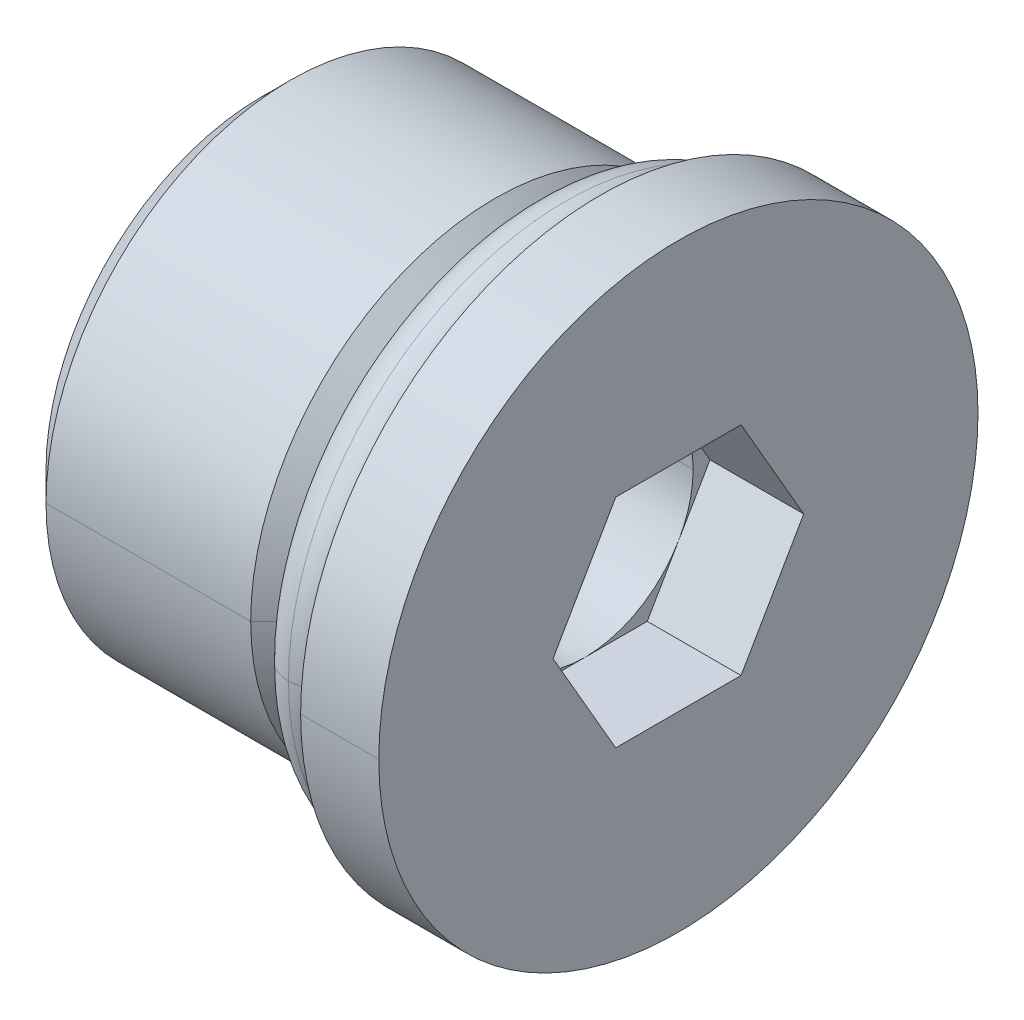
ISO-10303-21;
HEADER;
FILE_DESCRIPTION(('STEP AP214'),'2;1');
FILE_NAME('part.step','',(''),(''),'','','');
FILE_SCHEMA(('AUTOMOTIVE_DESIGN { 1 0 10303 214 1 1 1 1 }'));
ENDSEC;
DATA;
#1=APPLICATION_CONTEXT('core data for automotive mechanical design processes');
#2=APPLICATION_PROTOCOL_DEFINITION('international standard','automotive_design',2000,#1);
#3=PRODUCT_CONTEXT('',#1,'mechanical');
#4=PRODUCT('Part','Part','',(#3));
#5=PRODUCT_RELATED_PRODUCT_CATEGORY('part','',(#4));
#6=PRODUCT_DEFINITION_FORMATION('','',#4);
#7=PRODUCT_DEFINITION_CONTEXT('part definition',#1,'design');
#8=PRODUCT_DEFINITION('design','',#6,#7);
#9=PRODUCT_DEFINITION_SHAPE('','',#8);
#10=(LENGTH_UNIT() NAMED_UNIT(*) SI_UNIT(.MILLI.,.METRE.));
#11=(NAMED_UNIT(*) PLANE_ANGLE_UNIT() SI_UNIT($,.RADIAN.));
#12=(NAMED_UNIT(*) SI_UNIT($,.STERADIAN.) SOLID_ANGLE_UNIT());
#13=UNCERTAINTY_MEASURE_WITH_UNIT(LENGTH_MEASURE(1.E-05),#10,'distance_accuracy_value','');
#14=(GEOMETRIC_REPRESENTATION_CONTEXT(3) GLOBAL_UNCERTAINTY_ASSIGNED_CONTEXT((#13)) GLOBAL_UNIT_ASSIGNED_CONTEXT((#10,
#11,#12)) REPRESENTATION_CONTEXT('',''));
#15=CARTESIAN_POINT('',(0.,0.,0.));
#16=DIRECTION('',(0.,0.,1.));
#17=DIRECTION('',(1.,0.,0.));
#18=AXIS2_PLACEMENT_3D('',#15,#16,#17);
#19=CARTESIAN_POINT('',(8.89,0.,0.));
#20=DIRECTION('',(-1.,0.,0.));
#21=DIRECTION('',(0.,0.,1.));
#22=AXIS2_PLACEMENT_3D('',#19,#20,#21);
#23=TOROIDAL_SURFACE('',#22,7.112,0.9906);
#24=CARTESIAN_POINT('',(8.89,0.,0.));
#25=DIRECTION('',(-1.,0.,0.));
#26=DIRECTION('',(0.,0.,1.));
#27=AXIS2_PLACEMENT_3D('',#24,#25,#26);
#28=CIRCLE('',#27,8.1026);
#29=CARTESIAN_POINT('',(8.89,0.,-8.1026));
#30=VERTEX_POINT('',#29);
#31=CARTESIAN_POINT('',(8.89,0.,8.1026));
#32=VERTEX_POINT('',#31);
#33=EDGE_CURVE('P0_E19',#30,#32,#28,.T.);
#34=ORIENTED_EDGE('',*,*,#33,.F.);
#35=CARTESIAN_POINT('',(8.89,0.,-7.112));
#36=DIRECTION('',(0.,-1.,0.));
#37=DIRECTION('',(0.,0.,-1.));
#38=AXIS2_PLACEMENT_3D('',#35,#36,#37);
#39=CIRCLE('',#38,0.9906);
#40=CARTESIAN_POINT('',(8.89,0.,-6.1214));
#41=VERTEX_POINT('',#40);
#42=EDGE_CURVE('P0_E61',#30,#41,#39,.T.);
#43=ORIENTED_EDGE('',*,*,#42,.T.);
#44=CARTESIAN_POINT('',(8.89,0.,0.));
#45=DIRECTION('',(1.,0.,0.));
#46=DIRECTION('',(0.,0.,1.));
#47=AXIS2_PLACEMENT_3D('',#44,#45,#46);
#48=CIRCLE('',#47,6.1214);
#49=CARTESIAN_POINT('',(8.89,0.,6.1214));
#50=VERTEX_POINT('',#49);
#51=EDGE_CURVE('P0_E11',#50,#41,#48,.T.);
#52=ORIENTED_EDGE('',*,*,#51,.F.);
#53=CARTESIAN_POINT('',(8.89,0.,7.112));
#54=DIRECTION('',(0.,-1.,0.));
#55=DIRECTION('',(0.,0.,1.));
#56=AXIS2_PLACEMENT_3D('',#53,#54,#55);
#57=CIRCLE('',#56,0.9906);
#58=EDGE_CURVE('P0_E62',#50,#32,#57,.T.);
#59=ORIENTED_EDGE('',*,*,#58,.T.);
#60=EDGE_LOOP('',(#34,#43,#52,#59));
#61=FACE_BOUND('',#60,.T.);
#62=ADVANCED_FACE('P0_F16',(#61),#23,.T.);
#63=CARTESIAN_POINT('',(8.89,0.,0.));
#64=DIRECTION('',(-1.,0.,0.));
#65=DIRECTION('',(0.,0.,1.));
#66=AXIS2_PLACEMENT_3D('',#63,#64,#65);
#67=TOROIDAL_SURFACE('',#66,7.112,0.9906);
#68=ORIENTED_EDGE('',*,*,#33,.T.);
#69=CARTESIAN_POINT('',(8.89,0.,7.112));
#70=DIRECTION('',(0.,-1.,0.));
#71=DIRECTION('',(0.,0.,1.));
#72=AXIS2_PLACEMENT_3D('',#69,#70,#71);
#73=CIRCLE('',#72,0.9906);
#74=EDGE_CURVE('P0_E54',#32,#50,#73,.T.);
#75=ORIENTED_EDGE('',*,*,#74,.T.);
#76=ORIENTED_EDGE('',*,*,#51,.T.);
#77=CARTESIAN_POINT('',(8.89,0.,-7.112));
#78=DIRECTION('',(0.,-1.,0.));
#79=DIRECTION('',(0.,0.,-1.));
#80=AXIS2_PLACEMENT_3D('',#77,#78,#79);
#81=CIRCLE('',#80,0.9906);
#82=EDGE_CURVE('P0_E57',#41,#30,#81,.T.);
#83=ORIENTED_EDGE('',*,*,#82,.T.);
#84=EDGE_LOOP('',(#68,#75,#76,#83));
#85=FACE_BOUND('',#84,.T.);
#86=ADVANCED_FACE('P0_F52',(#85),#67,.T.);
#87=CARTESIAN_POINT('',(8.89,0.,0.));
#88=DIRECTION('',(-1.,0.,0.));
#89=DIRECTION('',(0.,0.,1.));
#90=AXIS2_PLACEMENT_3D('',#87,#88,#89);
#91=TOROIDAL_SURFACE('',#90,7.112,0.9906);
#92=CARTESIAN_POINT('',(8.89,0.,0.));
#93=DIRECTION('',(-1.,0.,0.));
#94=DIRECTION('',(0.,0.,1.));
#95=AXIS2_PLACEMENT_3D('',#92,#93,#94);
#96=CIRCLE('',#95,8.1026);
#97=EDGE_CURVE('P0_E70',#32,#30,#96,.T.);
#98=ORIENTED_EDGE('',*,*,#97,.F.);
#99=ORIENTED_EDGE('',*,*,#58,.F.);
#100=CARTESIAN_POINT('',(8.89,0.,0.));
#101=DIRECTION('',(1.,0.,0.));
#102=DIRECTION('',(0.,0.,1.));
#103=AXIS2_PLACEMENT_3D('',#100,#101,#102);
#104=CIRCLE('',#103,6.1214);
#105=EDGE_CURVE('P0_E71',#41,#50,#104,.T.);
#106=ORIENTED_EDGE('',*,*,#105,.F.);
#107=ORIENTED_EDGE('',*,*,#42,.F.);
#108=EDGE_LOOP('',(#98,#99,#106,#107));
#109=FACE_BOUND('',#108,.T.);
#110=ADVANCED_FACE('P0_F74',(#109),#91,.T.);
#111=CARTESIAN_POINT('',(8.89,0.,0.));
#112=DIRECTION('',(-1.,0.,0.));
#113=DIRECTION('',(0.,0.,1.));
#114=AXIS2_PLACEMENT_3D('',#111,#112,#113);
#115=TOROIDAL_SURFACE('',#114,7.112,0.9906);
#116=ORIENTED_EDGE('',*,*,#97,.T.);
#117=ORIENTED_EDGE('',*,*,#82,.F.);
#118=ORIENTED_EDGE('',*,*,#105,.T.);
#119=ORIENTED_EDGE('',*,*,#74,.F.);
#120=EDGE_LOOP('',(#116,#117,#118,#119));
#121=FACE_BOUND('',#120,.T.);
#122=ADVANCED_FACE('P0_F69',(#121),#115,.T.);
#123=CLOSED_SHELL('',(#62,#86,#110,#122));
#124=MANIFOLD_SOLID_BREP('P0_B1',#123);
#125=CARTESIAN_POINT('',(11.049,0.,0.));
#126=DIRECTION('',(1.,0.,0.));
#127=DIRECTION('',(0.,0.,1.));
#128=AXIS2_PLACEMENT_3D('',#125,#126,#127);
#129=CYLINDRICAL_SURFACE('',#128,8.763);
#130=DIRECTION('',(1.,0.,0.));
#131=VECTOR('',#130,1.);
#132=CARTESIAN_POINT('',(11.049,0.,8.763));
#133=LINE('',#132,#131);
#134=CARTESIAN_POINT('',(9.906,0.,8.763));
#135=VERTEX_POINT('',#134);
#136=CARTESIAN_POINT('',(12.192,0.,8.763));
#137=VERTEX_POINT('',#136);
#138=EDGE_CURVE('P1_E24',#135,#137,#133,.T.);
#139=ORIENTED_EDGE('',*,*,#138,.F.);
#140=CARTESIAN_POINT('',(9.906,0.,0.));
#141=DIRECTION('',(1.,0.,0.));
#142=DIRECTION('',(0.,0.,1.));
#143=AXIS2_PLACEMENT_3D('',#140,#141,#142);
#144=CIRCLE('',#143,8.763);
#145=CARTESIAN_POINT('',(9.906,0.,-8.763));
#146=VERTEX_POINT('',#145);
#147=EDGE_CURVE('P1_E405',#135,#146,#144,.T.);
#148=ORIENTED_EDGE('',*,*,#147,.T.);
#149=DIRECTION('',(-1.,0.,0.));
#150=VECTOR('',#149,1.);
#151=CARTESIAN_POINT('',(11.049,0.,-8.763));
#152=LINE('',#151,#150);
#153=CARTESIAN_POINT('',(12.192,0.,-8.763));
#154=VERTEX_POINT('',#153);
#155=EDGE_CURVE('P1_E11',#154,#146,#152,.T.);
#156=ORIENTED_EDGE('',*,*,#155,.F.);
#157=CARTESIAN_POINT('',(12.192,0.,0.));
#158=DIRECTION('',(1.,0.,0.));
#159=DIRECTION('',(0.,0.,1.));
#160=AXIS2_PLACEMENT_3D('',#157,#158,#159);
#161=CIRCLE('',#160,8.763);
#162=EDGE_CURVE('P1_E336',#137,#154,#161,.T.);
#163=ORIENTED_EDGE('',*,*,#162,.F.);
#164=EDGE_LOOP('',(#139,#148,#156,#163));
#165=FACE_BOUND('',#164,.T.);
#166=ADVANCED_FACE('P1_F16',(#165),#129,.T.);
#167=CARTESIAN_POINT('',(11.049,0.,0.));
#168=DIRECTION('',(1.,0.,0.));
#169=DIRECTION('',(0.,0.,1.));
#170=AXIS2_PLACEMENT_3D('',#167,#168,#169);
#171=CYLINDRICAL_SURFACE('',#170,8.763);
#172=ORIENTED_EDGE('',*,*,#138,.T.);
#173=CARTESIAN_POINT('',(12.192,0.,0.));
#174=DIRECTION('',(1.,0.,0.));
#175=DIRECTION('',(0.,0.,1.));
#176=AXIS2_PLACEMENT_3D('',#173,#174,#175);
#177=CIRCLE('',#176,8.763);
#178=EDGE_CURVE('P1_E340',#154,#137,#177,.T.);
#179=ORIENTED_EDGE('',*,*,#178,.F.);
#180=ORIENTED_EDGE('',*,*,#155,.T.);
#181=CARTESIAN_POINT('',(9.906,0.,0.));
#182=DIRECTION('',(1.,0.,0.));
#183=DIRECTION('',(0.,0.,1.));
#184=AXIS2_PLACEMENT_3D('',#181,#182,#183);
#185=CIRCLE('',#184,8.763);
#186=EDGE_CURVE('P1_E408',#146,#135,#185,.T.);
#187=ORIENTED_EDGE('',*,*,#186,.T.);
#188=EDGE_LOOP('',(#172,#179,#180,#187));
#189=FACE_BOUND('',#188,.T.);
#190=ADVANCED_FACE('P1_F413',(#189),#171,.T.);
#191=CARTESIAN_POINT('',(9.906,0.,4.3815));
#192=DIRECTION('',(-1.,0.,0.));
#193=DIRECTION('',(0.,0.,1.));
#194=AXIS2_PLACEMENT_3D('',#191,#192,#193);
#195=PLANE('',#194);
#196=ORIENTED_EDGE('',*,*,#147,.F.);
#197=ORIENTED_EDGE('',*,*,#186,.F.);
#198=EDGE_LOOP('',(#196,#197));
#199=FACE_BOUND('',#198,.T.);
#200=CARTESIAN_POINT('',(9.906,0.,0.));
#201=DIRECTION('',(1.,0.,0.));
#202=DIRECTION('',(0.,0.,1.));
#203=AXIS2_PLACEMENT_3D('',#200,#201,#202);
#204=CIRCLE('',#203,6.096);
#205=CARTESIAN_POINT('',(9.906,0.,6.096));
#206=VERTEX_POINT('',#205);
#207=CARTESIAN_POINT('',(9.906,0.,-6.096));
#208=VERTEX_POINT('',#207);
#209=EDGE_CURVE('P1_E341',#206,#208,#204,.T.);
#210=ORIENTED_EDGE('',*,*,#209,.T.);
#211=CARTESIAN_POINT('',(9.906,0.,0.));
#212=DIRECTION('',(1.,0.,0.));
#213=DIRECTION('',(0.,0.,1.));
#214=AXIS2_PLACEMENT_3D('',#211,#212,#213);
#215=CIRCLE('',#214,6.096);
#216=EDGE_CURVE('P1_E268',#208,#206,#215,.T.);
#217=ORIENTED_EDGE('',*,*,#216,.T.);
#218=EDGE_LOOP('',(#210,#217));
#219=FACE_BOUND('',#218,.T.);
#220=ADVANCED_FACE('P1_F419',(#199,#219),#195,.T.);
#221=CARTESIAN_POINT('',(12.192,0.,4.3815));
#222=DIRECTION('',(1.,0.,0.));
#223=DIRECTION('',(0.,0.,1.));
#224=AXIS2_PLACEMENT_3D('',#221,#222,#223);
#225=PLANE('',#224);
#226=ORIENTED_EDGE('',*,*,#162,.T.);
#227=ORIENTED_EDGE('',*,*,#178,.T.);
#228=EDGE_LOOP('',(#226,#227));
#229=FACE_BOUND('',#228,.T.);
#230=DIRECTION('',(0.,0.,-1.));
#231=VECTOR('',#230,1.);
#232=CARTESIAN_POINT('',(12.192,3.175,2.19075));
#233=LINE('',#232,#231);
#234=CARTESIAN_POINT('',(12.192,3.175,1.83308710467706));
#235=VERTEX_POINT('',#234);
#236=CARTESIAN_POINT('',(12.192,3.175,-1.83308710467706));
#237=VERTEX_POINT('',#236);
#238=EDGE_CURVE('P1_E392',#235,#237,#233,.T.);
#239=ORIENTED_EDGE('',*,*,#238,.T.);
#240=DIRECTION('',(0.,-0.866025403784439,-0.5));
#241=VECTOR('',#240,1.);
#242=CARTESIAN_POINT('',(12.192,1.74237257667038,-2.66021493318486));
#243=LINE('',#242,#241);
#244=CARTESIAN_POINT('',(12.192,0.,-3.66617420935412));
#245=VERTEX_POINT('',#244);
#246=EDGE_CURVE('P1_E386',#237,#245,#243,.T.);
#247=ORIENTED_EDGE('',*,*,#246,.T.);
#248=DIRECTION('',(0.,-0.866025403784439,0.5));
#249=VECTOR('',#248,1.);
#250=CARTESIAN_POINT('',(12.192,-3.32987257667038,-1.74367138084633));
#251=LINE('',#250,#249);
#252=CARTESIAN_POINT('',(12.192,-3.175,-1.83308710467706));
#253=VERTEX_POINT('',#252);
#254=EDGE_CURVE('P1_E319',#245,#253,#251,.T.);
#255=ORIENTED_EDGE('',*,*,#254,.T.);
#256=DIRECTION('',(0.,0.,1.));
#257=VECTOR('',#256,1.);
#258=CARTESIAN_POINT('',(12.192,-3.175,3.10729355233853));
#259=LINE('',#258,#257);
#260=CARTESIAN_POINT('',(12.192,-3.175,1.83308710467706));
#261=VERTEX_POINT('',#260);
#262=EDGE_CURVE('P1_E346',#253,#261,#259,.T.);
#263=ORIENTED_EDGE('',*,*,#262,.T.);
#264=DIRECTION('',(0.,0.866025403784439,0.5));
#265=VECTOR('',#264,1.);
#266=CARTESIAN_POINT('',(12.192,0.154872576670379,3.75558993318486));
#267=LINE('',#266,#265);
#268=CARTESIAN_POINT('',(12.192,0.,3.66617420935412));
#269=VERTEX_POINT('',#268);
#270=EDGE_CURVE('P1_E377',#261,#269,#267,.T.);
#271=ORIENTED_EDGE('',*,*,#270,.T.);
#272=DIRECTION('',(0.,0.866025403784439,-0.5));
#273=VECTOR('',#272,1.);
#274=CARTESIAN_POINT('',(12.192,1.43262742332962,2.83904638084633));
#275=LINE('',#274,#273);
#276=EDGE_CURVE('P1_E370',#269,#235,#275,.T.);
#277=ORIENTED_EDGE('',*,*,#276,.T.);
#278=EDGE_LOOP('',(#239,#247,#255,#263,#271,#277));
#279=FACE_BOUND('',#278,.T.);
#280=ADVANCED_FACE('P1_F416',(#229,#279),#225,.T.);
#281=CARTESIAN_POINT('',(8.89,0.,0.));
#282=DIRECTION('',(1.,0.,0.));
#283=DIRECTION('',(0.,0.,1.));
#284=AXIS2_PLACEMENT_3D('',#281,#282,#283);
#285=CYLINDRICAL_SURFACE('',#284,6.096);
#286=DIRECTION('',(1.,0.,0.));
#287=VECTOR('',#286,1.);
#288=CARTESIAN_POINT('',(8.89,0.,6.096));
#289=LINE('',#288,#287);
#290=CARTESIAN_POINT('',(7.874,0.,6.096));
#291=VERTEX_POINT('',#290);
#292=EDGE_CURVE('P1_E273',#291,#206,#289,.T.);
#293=ORIENTED_EDGE('',*,*,#292,.F.);
#294=CARTESIAN_POINT('',(7.874,0.,0.));
#295=DIRECTION('',(1.,0.,0.));
#296=DIRECTION('',(0.,0.,1.));
#297=AXIS2_PLACEMENT_3D('',#294,#295,#296);
#298=CIRCLE('',#297,6.096);
#299=CARTESIAN_POINT('',(7.874,0.,-6.096));
#300=VERTEX_POINT('',#299);
#301=EDGE_CURVE('P1_E230',#291,#300,#298,.T.);
#302=ORIENTED_EDGE('',*,*,#301,.T.);
#303=DIRECTION('',(-1.,0.,0.));
#304=VECTOR('',#303,1.);
#305=CARTESIAN_POINT('',(8.89,0.,-6.096));
#306=LINE('',#305,#304);
#307=EDGE_CURVE('P1_E272',#208,#300,#306,.T.);
#308=ORIENTED_EDGE('',*,*,#307,.F.);
#309=ORIENTED_EDGE('',*,*,#209,.F.);
#310=EDGE_LOOP('',(#293,#302,#308,#309));
#311=FACE_BOUND('',#310,.T.);
#312=ADVANCED_FACE('P1_F426',(#311),#285,.T.);
#313=CARTESIAN_POINT('',(8.89,0.,0.));
#314=DIRECTION('',(1.,0.,0.));
#315=DIRECTION('',(0.,0.,1.));
#316=AXIS2_PLACEMENT_3D('',#313,#314,#315);
#317=CYLINDRICAL_SURFACE('',#316,6.096);
#318=ORIENTED_EDGE('',*,*,#292,.T.);
#319=ORIENTED_EDGE('',*,*,#216,.F.);
#320=ORIENTED_EDGE('',*,*,#307,.T.);
#321=CARTESIAN_POINT('',(7.874,0.,0.));
#322=DIRECTION('',(1.,0.,0.));
#323=DIRECTION('',(0.,0.,1.));
#324=AXIS2_PLACEMENT_3D('',#321,#322,#323);
#325=CIRCLE('',#324,6.096);
#326=EDGE_CURVE('P1_E231',#300,#291,#325,.T.);
#327=ORIENTED_EDGE('',*,*,#326,.T.);
#328=EDGE_LOOP('',(#318,#319,#320,#327));
#329=FACE_BOUND('',#328,.T.);
#330=ADVANCED_FACE('P1_F430',(#329),#317,.T.);
#331=CARTESIAN_POINT('',(12.192,3.175,0.));
#332=DIRECTION('',(0.,1.,0.));
#333=DIRECTION('',(0.,0.,-1.));
#334=AXIS2_PLACEMENT_3D('',#331,#332,#333);
#335=PLANE('',#334);
#336=DIRECTION('',(-1.,0.,0.));
#337=VECTOR('',#336,1.);
#338=CARTESIAN_POINT('',(12.192,3.175,-1.83308710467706));
#339=LINE('',#338,#337);
#340=CARTESIAN_POINT('',(9.4488,3.175,-1.83308710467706));
#341=VERTEX_POINT('',#340);
#342=EDGE_CURVE('P1_E389',#237,#341,#339,.T.);
#343=ORIENTED_EDGE('',*,*,#342,.F.);
#344=ORIENTED_EDGE('',*,*,#238,.F.);
#345=DIRECTION('',(-1.,0.,0.));
#346=VECTOR('',#345,1.);
#347=CARTESIAN_POINT('',(12.192,3.175,1.83308710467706));
#348=LINE('',#347,#346);
#349=CARTESIAN_POINT('',(9.4488,3.175,1.83308710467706));
#350=VERTEX_POINT('',#349);
#351=EDGE_CURVE('P1_E367',#235,#350,#348,.T.);
#352=ORIENTED_EDGE('',*,*,#351,.T.);
#353=DIRECTION('',(0.,0.,1.));
#354=VECTOR('',#353,1.);
#355=CARTESIAN_POINT('',(9.4488,3.175,1.83308710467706));
#356=LINE('',#355,#354);
#357=CARTESIAN_POINT('',(9.4488,3.175,0.));
#358=VERTEX_POINT('',#357);
#359=EDGE_CURVE('P1_E353',#358,#350,#356,.T.);
#360=ORIENTED_EDGE('',*,*,#359,.F.);
#361=DIRECTION('',(0.,0.,1.));
#362=VECTOR('',#361,1.);
#363=CARTESIAN_POINT('',(9.4488,3.175,1.83308710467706));
#364=LINE('',#363,#362);
#365=EDGE_CURVE('P1_E345',#341,#358,#364,.T.);
#366=ORIENTED_EDGE('',*,*,#365,.F.);
#367=EDGE_LOOP('',(#343,#344,#352,#360,#366));
#368=FACE_BOUND('',#367,.T.);
#369=ADVANCED_FACE('P1_F469',(#368),#335,.F.);
#370=CARTESIAN_POINT('',(12.192,0.,-3.66617420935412));
#371=DIRECTION('',(0.,0.5,-0.866025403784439));
#372=DIRECTION('',(-1.,0.,0.));
#373=AXIS2_PLACEMENT_3D('',#370,#371,#372);
#374=PLANE('',#373);
#375=DIRECTION('',(-1.,0.,0.));
#376=VECTOR('',#375,1.);
#377=CARTESIAN_POINT('',(12.192,0.,-3.66617420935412));
#378=LINE('',#377,#376);
#379=CARTESIAN_POINT('',(9.4488,0.,-3.66617420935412));
#380=VERTEX_POINT('',#379);
#381=EDGE_CURVE('P1_E322',#245,#380,#378,.T.);
#382=ORIENTED_EDGE('',*,*,#381,.F.);
#383=ORIENTED_EDGE('',*,*,#246,.F.);
#384=ORIENTED_EDGE('',*,*,#342,.T.);
#385=DIRECTION('',(0.,0.866025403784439,0.5));
#386=VECTOR('',#385,1.);
#387=CARTESIAN_POINT('',(9.4488,3.175,-1.83308710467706));
#388=LINE('',#387,#386);
#389=CARTESIAN_POINT('',(9.4488,1.5875,-2.74963065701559));
#390=VERTEX_POINT('',#389);
#391=EDGE_CURVE('P1_E335',#390,#341,#388,.T.);
#392=ORIENTED_EDGE('',*,*,#391,.F.);
#393=DIRECTION('',(0.,0.866025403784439,0.5));
#394=VECTOR('',#393,1.);
#395=CARTESIAN_POINT('',(9.4488,3.175,-1.83308710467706));
#396=LINE('',#395,#394);
#397=EDGE_CURVE('P1_E331',#380,#390,#396,.T.);
#398=ORIENTED_EDGE('',*,*,#397,.F.);
#399=EDGE_LOOP('',(#382,#383,#384,#392,#398));
#400=FACE_BOUND('',#399,.T.);
#401=ADVANCED_FACE('P1_F472',(#400),#374,.F.);
#402=CARTESIAN_POINT('',(12.192,-3.175,-1.83308710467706));
#403=DIRECTION('',(0.,-0.5,-0.866025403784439));
#404=DIRECTION('',(0.,-0.866025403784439,0.5));
#405=AXIS2_PLACEMENT_3D('',#402,#403,#404);
#406=PLANE('',#405);
#407=DIRECTION('',(-1.,0.,0.));
#408=VECTOR('',#407,1.);
#409=CARTESIAN_POINT('',(12.192,-3.175,-1.83308710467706));
#410=LINE('',#409,#408);
#411=CARTESIAN_POINT('',(9.4488,-3.175,-1.83308710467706));
#412=VERTEX_POINT('',#411);
#413=EDGE_CURVE('P1_E323',#253,#412,#410,.T.);
#414=ORIENTED_EDGE('',*,*,#413,.F.);
#415=ORIENTED_EDGE('',*,*,#254,.F.);
#416=ORIENTED_EDGE('',*,*,#381,.T.);
#417=DIRECTION('',(0.,0.866025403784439,-0.5));
#418=VECTOR('',#417,1.);
#419=CARTESIAN_POINT('',(9.4488,0.,-3.66617420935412));
#420=LINE('',#419,#418);
#421=CARTESIAN_POINT('',(9.4488,-1.5875,-2.74963065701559));
#422=VERTEX_POINT('',#421);
#423=EDGE_CURVE('P1_E327',#422,#380,#420,.T.);
#424=ORIENTED_EDGE('',*,*,#423,.F.);
#425=DIRECTION('',(0.,0.866025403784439,-0.5));
#426=VECTOR('',#425,1.);
#427=CARTESIAN_POINT('',(9.4488,0.,-3.66617420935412));
#428=LINE('',#427,#426);
#429=EDGE_CURVE('P1_E318',#412,#422,#428,.T.);
#430=ORIENTED_EDGE('',*,*,#429,.F.);
#431=EDGE_LOOP('',(#414,#415,#416,#424,#430));
#432=FACE_BOUND('',#431,.T.);
#433=ADVANCED_FACE('P1_F476',(#432),#406,.F.);
#434=CARTESIAN_POINT('',(12.192,-3.175,1.83308710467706));
#435=DIRECTION('',(0.,-1.,0.));
#436=DIRECTION('',(0.,0.,-1.));
#437=AXIS2_PLACEMENT_3D('',#434,#435,#436);
#438=PLANE('',#437);
#439=DIRECTION('',(-1.,0.,0.));
#440=VECTOR('',#439,1.);
#441=CARTESIAN_POINT('',(12.192,-3.175,1.83308710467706));
#442=LINE('',#441,#440);
#443=CARTESIAN_POINT('',(9.4488,-3.175,1.83308710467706));
#444=VERTEX_POINT('',#443);
#445=EDGE_CURVE('P1_E349',#261,#444,#442,.T.);
#446=ORIENTED_EDGE('',*,*,#445,.F.);
#447=ORIENTED_EDGE('',*,*,#262,.F.);
#448=ORIENTED_EDGE('',*,*,#413,.T.);
#449=DIRECTION('',(0.,0.,-1.));
#450=VECTOR('',#449,1.);
#451=CARTESIAN_POINT('',(9.4488,-3.175,-1.83308710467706));
#452=LINE('',#451,#450);
#453=CARTESIAN_POINT('',(9.4488,-3.175,0.));
#454=VERTEX_POINT('',#453);
#455=EDGE_CURVE('P1_E314',#454,#412,#452,.T.);
#456=ORIENTED_EDGE('',*,*,#455,.F.);
#457=DIRECTION('',(0.,0.,-1.));
#458=VECTOR('',#457,1.);
#459=CARTESIAN_POINT('',(9.4488,-3.175,-1.83308710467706));
#460=LINE('',#459,#458);
#461=EDGE_CURVE('P1_E310',#444,#454,#460,.T.);
#462=ORIENTED_EDGE('',*,*,#461,.F.);
#463=EDGE_LOOP('',(#446,#447,#448,#456,#462));
#464=FACE_BOUND('',#463,.T.);
#465=ADVANCED_FACE('P1_F480',(#464),#438,.F.);
#466=CARTESIAN_POINT('',(12.192,0.,3.66617420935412));
#467=DIRECTION('',(0.,-0.5,0.866025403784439));
#468=DIRECTION('',(-1.,0.,0.));
#469=AXIS2_PLACEMENT_3D('',#466,#467,#468);
#470=PLANE('',#469);
#471=DIRECTION('',(-1.,0.,0.));
#472=VECTOR('',#471,1.);
#473=CARTESIAN_POINT('',(12.192,0.,3.66617420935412));
#474=LINE('',#473,#472);
#475=CARTESIAN_POINT('',(9.4488,0.,3.66617420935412));
#476=VERTEX_POINT('',#475);
#477=EDGE_CURVE('P1_E374',#269,#476,#474,.T.);
#478=ORIENTED_EDGE('',*,*,#477,.F.);
#479=ORIENTED_EDGE('',*,*,#270,.F.);
#480=ORIENTED_EDGE('',*,*,#445,.T.);
#481=DIRECTION('',(0.,-0.866025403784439,-0.5));
#482=VECTOR('',#481,1.);
#483=CARTESIAN_POINT('',(9.4488,-3.175,1.83308710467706));
#484=LINE('',#483,#482);
#485=CARTESIAN_POINT('',(9.4488,-1.5875,2.74963065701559));
#486=VERTEX_POINT('',#485);
#487=EDGE_CURVE('P1_E306',#486,#444,#484,.T.);
#488=ORIENTED_EDGE('',*,*,#487,.F.);
#489=DIRECTION('',(0.,-0.866025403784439,-0.5));
#490=VECTOR('',#489,1.);
#491=CARTESIAN_POINT('',(9.4488,-3.175,1.83308710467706));
#492=LINE('',#491,#490);
#493=EDGE_CURVE('P1_E302',#476,#486,#492,.T.);
#494=ORIENTED_EDGE('',*,*,#493,.F.);
#495=EDGE_LOOP('',(#478,#479,#480,#488,#494));
#496=FACE_BOUND('',#495,.T.);
#497=ADVANCED_FACE('P1_F484',(#496),#470,.F.);
#498=CARTESIAN_POINT('',(12.192,3.175,1.83308710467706));
#499=DIRECTION('',(0.,0.5,0.866025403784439));
#500=DIRECTION('',(1.,0.,0.));
#501=AXIS2_PLACEMENT_3D('',#498,#499,#500);
#502=PLANE('',#501);
#503=ORIENTED_EDGE('',*,*,#351,.F.);
#504=ORIENTED_EDGE('',*,*,#276,.F.);
#505=ORIENTED_EDGE('',*,*,#477,.T.);
#506=DIRECTION('',(0.,-0.866025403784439,0.5));
#507=VECTOR('',#506,1.);
#508=CARTESIAN_POINT('',(9.4488,0.,3.66617420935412));
#509=LINE('',#508,#507);
#510=CARTESIAN_POINT('',(9.4488,1.5875,2.74963065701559));
#511=VERTEX_POINT('',#510);
#512=EDGE_CURVE('P1_E298',#511,#476,#509,.T.);
#513=ORIENTED_EDGE('',*,*,#512,.F.);
#514=DIRECTION('',(0.,-0.866025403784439,0.5));
#515=VECTOR('',#514,1.);
#516=CARTESIAN_POINT('',(9.4488,0.,3.66617420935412));
#517=LINE('',#516,#515);
#518=EDGE_CURVE('P1_E215',#350,#511,#517,.T.);
#519=ORIENTED_EDGE('',*,*,#518,.F.);
#520=EDGE_LOOP('',(#503,#504,#505,#513,#519));
#521=FACE_BOUND('',#520,.T.);
#522=ADVANCED_FACE('P1_F488',(#521),#502,.F.);
#523=CARTESIAN_POINT('',(7.350125,0.,0.));
#524=DIRECTION('',(-1.,0.,0.));
#525=DIRECTION('',(0.,0.,1.));
#526=AXIS2_PLACEMENT_3D('',#523,#524,#525);
#527=CONICAL_SURFACE('',#526,6.619875,0.785398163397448);
#528=DIRECTION('',(0.707106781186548,0.,-0.707106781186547));
#529=VECTOR('',#528,1.);
#530=CARTESIAN_POINT('',(7.350125,0.,6.619875));
#531=LINE('',#530,#529);
#532=CARTESIAN_POINT('',(6.82625,0.,7.14375));
#533=VERTEX_POINT('',#532);
#534=EDGE_CURVE('P1_E357',#533,#291,#531,.T.);
#535=ORIENTED_EDGE('',*,*,#534,.F.);
#536=CARTESIAN_POINT('',(6.82625,0.,0.));
#537=DIRECTION('',(1.,0.,0.));
#538=DIRECTION('',(0.,0.,1.));
#539=AXIS2_PLACEMENT_3D('',#536,#537,#538);
#540=CIRCLE('',#539,7.14375);
#541=CARTESIAN_POINT('',(6.82625,0.,-7.14375));
#542=VERTEX_POINT('',#541);
#543=EDGE_CURVE('P1_E244',#533,#542,#540,.T.);
#544=ORIENTED_EDGE('',*,*,#543,.T.);
#545=DIRECTION('',(-0.707106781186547,0.,-0.707106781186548));
#546=VECTOR('',#545,1.);
#547=CARTESIAN_POINT('',(7.350125,0.,-6.619875));
#548=LINE('',#547,#546);
#549=EDGE_CURVE('P1_E227',#300,#542,#548,.T.);
#550=ORIENTED_EDGE('',*,*,#549,.F.);
#551=ORIENTED_EDGE('',*,*,#301,.F.);
#552=EDGE_LOOP('',(#535,#544,#550,#551));
#553=FACE_BOUND('',#552,.T.);
#554=ADVANCED_FACE('P1_F433',(#553),#527,.T.);
#555=CARTESIAN_POINT('',(7.350125,0.,0.));
#556=DIRECTION('',(-1.,0.,0.));
#557=DIRECTION('',(0.,0.,1.));
#558=AXIS2_PLACEMENT_3D('',#555,#556,#557);
#559=CONICAL_SURFACE('',#558,6.619875,0.785398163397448);
#560=ORIENTED_EDGE('',*,*,#534,.T.);
#561=ORIENTED_EDGE('',*,*,#326,.F.);
#562=ORIENTED_EDGE('',*,*,#549,.T.);
#563=CARTESIAN_POINT('',(6.82625,0.,0.));
#564=DIRECTION('',(1.,0.,0.));
#565=DIRECTION('',(0.,0.,1.));
#566=AXIS2_PLACEMENT_3D('',#563,#564,#565);
#567=CIRCLE('',#566,7.14375);
#568=EDGE_CURVE('P1_E245',#542,#533,#567,.T.);
#569=ORIENTED_EDGE('',*,*,#568,.T.);
#570=EDGE_LOOP('',(#560,#561,#562,#569));
#571=FACE_BOUND('',#570,.T.);
#572=ADVANCED_FACE('P1_F437',(#571),#559,.T.);
#573=CARTESIAN_POINT('',(9.4488,0.,0.));
#574=DIRECTION('',(-1.,0.,0.));
#575=DIRECTION('',(0.,0.,1.));
#576=AXIS2_PLACEMENT_3D('',#573,#574,#575);
#577=PLANE('',#576);
#578=CARTESIAN_POINT('',(9.4488,0.,0.));
#579=DIRECTION('',(-1.,0.,0.));
#580=DIRECTION('',(0.,0.,-1.));
#581=AXIS2_PLACEMENT_3D('',#578,#579,#580);
#582=CIRCLE('',#581,3.175);
#583=EDGE_CURVE('P1_E217',#511,#358,#582,.T.);
#584=ORIENTED_EDGE('',*,*,#583,.T.);
#585=ORIENTED_EDGE('',*,*,#359,.T.);
#586=ORIENTED_EDGE('',*,*,#518,.T.);
#587=EDGE_LOOP('',(#584,#585,#586));
#588=FACE_BOUND('',#587,.T.);
#589=ADVANCED_FACE('P1_F499',(#588),#577,.F.);
#590=CARTESIAN_POINT('',(9.4488,0.,0.));
#591=DIRECTION('',(-1.,0.,0.));
#592=DIRECTION('',(0.,0.,1.));
#593=AXIS2_PLACEMENT_3D('',#590,#591,#592);
#594=PLANE('',#593);
#595=CARTESIAN_POINT('',(9.4488,0.,0.));
#596=DIRECTION('',(-1.,0.,0.));
#597=DIRECTION('',(0.,0.,-1.));
#598=AXIS2_PLACEMENT_3D('',#595,#596,#597);
#599=CIRCLE('',#598,3.175);
#600=EDGE_CURVE('P1_E221',#358,#390,#599,.T.);
#601=ORIENTED_EDGE('',*,*,#600,.T.);
#602=ORIENTED_EDGE('',*,*,#391,.T.);
#603=ORIENTED_EDGE('',*,*,#365,.T.);
#604=EDGE_LOOP('',(#601,#602,#603));
#605=FACE_BOUND('',#604,.T.);
#606=ADVANCED_FACE('P1_F495',(#605),#594,.F.);
#607=CARTESIAN_POINT('',(9.4488,0.,0.));
#608=DIRECTION('',(-1.,0.,0.));
#609=DIRECTION('',(0.,0.,1.));
#610=AXIS2_PLACEMENT_3D('',#607,#608,#609);
#611=PLANE('',#610);
#612=CARTESIAN_POINT('',(9.4488,0.,0.));
#613=DIRECTION('',(-1.,0.,0.));
#614=DIRECTION('',(0.,0.,-1.));
#615=AXIS2_PLACEMENT_3D('',#612,#613,#614);
#616=CIRCLE('',#615,3.175);
#617=CARTESIAN_POINT('',(9.4488,0.,-3.175));
#618=VERTEX_POINT('',#617);
#619=EDGE_CURVE('P1_E266',#390,#618,#616,.T.);
#620=ORIENTED_EDGE('',*,*,#619,.T.);
#621=CARTESIAN_POINT('',(9.4488,0.,0.));
#622=DIRECTION('',(-1.,0.,0.));
#623=DIRECTION('',(0.,0.,-1.));
#624=AXIS2_PLACEMENT_3D('',#621,#622,#623);
#625=CIRCLE('',#624,3.175);
#626=EDGE_CURVE('P1_E262',#618,#422,#625,.T.);
#627=ORIENTED_EDGE('',*,*,#626,.T.);
#628=ORIENTED_EDGE('',*,*,#423,.T.);
#629=ORIENTED_EDGE('',*,*,#397,.T.);
#630=EDGE_LOOP('',(#620,#627,#628,#629));
#631=FACE_BOUND('',#630,.T.);
#632=ADVANCED_FACE('P1_F498',(#631),#611,.F.);
#633=CARTESIAN_POINT('',(9.4488,0.,0.));
#634=DIRECTION('',(-1.,0.,0.));
#635=DIRECTION('',(0.,0.,1.));
#636=AXIS2_PLACEMENT_3D('',#633,#634,#635);
#637=PLANE('',#636);
#638=CARTESIAN_POINT('',(9.4488,0.,0.));
#639=DIRECTION('',(-1.,0.,0.));
#640=DIRECTION('',(0.,0.,-1.));
#641=AXIS2_PLACEMENT_3D('',#638,#639,#640);
#642=CIRCLE('',#641,3.175);
#643=EDGE_CURVE('P1_E267',#422,#454,#642,.T.);
#644=ORIENTED_EDGE('',*,*,#643,.T.);
#645=ORIENTED_EDGE('',*,*,#455,.T.);
#646=ORIENTED_EDGE('',*,*,#429,.T.);
#647=EDGE_LOOP('',(#644,#645,#646));
#648=FACE_BOUND('',#647,.T.);
#649=ADVANCED_FACE('P1_F504',(#648),#637,.F.);
#650=CARTESIAN_POINT('',(9.4488,0.,0.));
#651=DIRECTION('',(-1.,0.,0.));
#652=DIRECTION('',(0.,0.,1.));
#653=AXIS2_PLACEMENT_3D('',#650,#651,#652);
#654=PLANE('',#653);
#655=CARTESIAN_POINT('',(9.4488,0.,0.));
#656=DIRECTION('',(-1.,0.,0.));
#657=DIRECTION('',(0.,0.,-1.));
#658=AXIS2_PLACEMENT_3D('',#655,#656,#657);
#659=CIRCLE('',#658,3.175);
#660=EDGE_CURVE('P1_E261',#454,#486,#659,.T.);
#661=ORIENTED_EDGE('',*,*,#660,.T.);
#662=ORIENTED_EDGE('',*,*,#487,.T.);
#663=ORIENTED_EDGE('',*,*,#461,.T.);
#664=EDGE_LOOP('',(#661,#662,#663));
#665=FACE_BOUND('',#664,.T.);
#666=ADVANCED_FACE('P1_F453',(#665),#654,.F.);
#667=CARTESIAN_POINT('',(9.4488,0.,0.));
#668=DIRECTION('',(-1.,0.,0.));
#669=DIRECTION('',(0.,0.,1.));
#670=AXIS2_PLACEMENT_3D('',#667,#668,#669);
#671=PLANE('',#670);
#672=CARTESIAN_POINT('',(9.4488,0.,0.));
#673=DIRECTION('',(-1.,0.,0.));
#674=DIRECTION('',(0.,0.,-1.));
#675=AXIS2_PLACEMENT_3D('',#672,#673,#674);
#676=CIRCLE('',#675,3.175);
#677=CARTESIAN_POINT('',(9.4488,0.,3.175));
#678=VERTEX_POINT('',#677);
#679=EDGE_CURVE('P1_E257',#486,#678,#676,.T.);
#680=ORIENTED_EDGE('',*,*,#679,.T.);
#681=CARTESIAN_POINT('',(9.4488,0.,0.));
#682=DIRECTION('',(-1.,0.,0.));
#683=DIRECTION('',(0.,0.,-1.));
#684=AXIS2_PLACEMENT_3D('',#681,#682,#683);
#685=CIRCLE('',#684,3.175);
#686=EDGE_CURVE('P1_E220',#678,#511,#685,.T.);
#687=ORIENTED_EDGE('',*,*,#686,.T.);
#688=ORIENTED_EDGE('',*,*,#512,.T.);
#689=ORIENTED_EDGE('',*,*,#493,.T.);
#690=EDGE_LOOP('',(#680,#687,#688,#689));
#691=FACE_BOUND('',#690,.T.);
#692=ADVANCED_FACE('P1_F444',(#691),#671,.F.);
#693=CARTESIAN_POINT('',(3.83286,0.,0.));
#694=DIRECTION('',(1.,0.,0.));
#695=DIRECTION('',(0.,0.,1.));
#696=AXIS2_PLACEMENT_3D('',#693,#694,#695);
#697=CYLINDRICAL_SURFACE('',#696,7.14375);
#698=DIRECTION('',(1.,0.,0.));
#699=VECTOR('',#698,1.);
#700=CARTESIAN_POINT('',(3.83286,0.,7.14375));
#701=LINE('',#700,#699);
#702=CARTESIAN_POINT('',(0.83947,0.,7.14375));
#703=VERTEX_POINT('',#702);
#704=EDGE_CURVE('P1_E288',#703,#533,#701,.T.);
#705=ORIENTED_EDGE('',*,*,#704,.F.);
#706=CARTESIAN_POINT('',(0.83947,0.,0.));
#707=DIRECTION('',(1.,0.,0.));
#708=DIRECTION('',(0.,0.,1.));
#709=AXIS2_PLACEMENT_3D('',#706,#707,#708);
#710=CIRCLE('',#709,7.14375);
#711=CARTESIAN_POINT('',(0.83947,0.,-7.14375));
#712=VERTEX_POINT('',#711);
#713=EDGE_CURVE('P1_E191',#703,#712,#710,.T.);
#714=ORIENTED_EDGE('',*,*,#713,.T.);
#715=DIRECTION('',(-1.,0.,0.));
#716=VECTOR('',#715,1.);
#717=CARTESIAN_POINT('',(3.83286,0.,-7.14375));
#718=LINE('',#717,#716);
#719=EDGE_CURVE('P1_E241',#542,#712,#718,.T.);
#720=ORIENTED_EDGE('',*,*,#719,.F.);
#721=ORIENTED_EDGE('',*,*,#543,.F.);
#722=EDGE_LOOP('',(#705,#714,#720,#721));
#723=FACE_BOUND('',#722,.T.);
#724=ADVANCED_FACE('P1_F442',(#723),#697,.T.);
#725=CARTESIAN_POINT('',(3.83286,0.,0.));
#726=DIRECTION('',(1.,0.,0.));
#727=DIRECTION('',(0.,0.,1.));
#728=AXIS2_PLACEMENT_3D('',#725,#726,#727);
#729=CYLINDRICAL_SURFACE('',#728,7.14375);
#730=ORIENTED_EDGE('',*,*,#704,.T.);
#731=ORIENTED_EDGE('',*,*,#568,.F.);
#732=ORIENTED_EDGE('',*,*,#719,.T.);
#733=CARTESIAN_POINT('',(0.83947,0.,0.));
#734=DIRECTION('',(1.,0.,0.));
#735=DIRECTION('',(0.,0.,1.));
#736=AXIS2_PLACEMENT_3D('',#733,#734,#735);
#737=CIRCLE('',#736,7.14375);
#738=EDGE_CURVE('P1_E196',#712,#703,#737,.T.);
#739=ORIENTED_EDGE('',*,*,#738,.T.);
#740=EDGE_LOOP('',(#730,#731,#732,#739));
#741=FACE_BOUND('',#740,.T.);
#742=ADVANCED_FACE('P1_F440',(#741),#729,.T.);
#743=CARTESIAN_POINT('',(9.4488,0.,0.));
#744=DIRECTION('',(-1.,0.,0.));
#745=DIRECTION('',(0.,0.,-1.));
#746=AXIS2_PLACEMENT_3D('',#743,#744,#745);
#747=CYLINDRICAL_SURFACE('',#746,3.175);
#748=DIRECTION('',(1.,0.,0.));
#749=VECTOR('',#748,1.);
#750=CARTESIAN_POINT('',(9.4488,0.,-3.175));
#751=LINE('',#750,#749);
#752=CARTESIAN_POINT('',(6.7056,0.,-3.175));
#753=VERTEX_POINT('',#752);
#754=EDGE_CURVE('P1_E234',#753,#618,#751,.T.);
#755=ORIENTED_EDGE('',*,*,#754,.T.);
#756=ORIENTED_EDGE('',*,*,#619,.F.);
#757=ORIENTED_EDGE('',*,*,#600,.F.);
#758=ORIENTED_EDGE('',*,*,#583,.F.);
#759=ORIENTED_EDGE('',*,*,#686,.F.);
#760=DIRECTION('',(-1.,0.,0.));
#761=VECTOR('',#760,1.);
#762=CARTESIAN_POINT('',(9.4488,0.,3.175));
#763=LINE('',#762,#761);
#764=CARTESIAN_POINT('',(6.7056,0.,3.175));
#765=VERTEX_POINT('',#764);
#766=EDGE_CURVE('P1_E254',#678,#765,#763,.T.);
#767=ORIENTED_EDGE('',*,*,#766,.T.);
#768=CARTESIAN_POINT('',(6.7056,0.,0.));
#769=DIRECTION('',(-1.,0.,0.));
#770=DIRECTION('',(0.,0.,-1.));
#771=AXIS2_PLACEMENT_3D('',#768,#769,#770);
#772=CIRCLE('',#771,3.175);
#773=EDGE_CURVE('P1_E197',#765,#753,#772,.T.);
#774=ORIENTED_EDGE('',*,*,#773,.T.);
#775=EDGE_LOOP('',(#755,#756,#757,#758,#759,#767,#774));
#776=FACE_BOUND('',#775,.T.);
#777=ADVANCED_FACE('P1_F451',(#776),#747,.F.);
#778=CARTESIAN_POINT('',(9.4488,0.,0.));
#779=DIRECTION('',(-1.,0.,0.));
#780=DIRECTION('',(0.,0.,-1.));
#781=AXIS2_PLACEMENT_3D('',#778,#779,#780);
#782=CYLINDRICAL_SURFACE('',#781,3.175);
#783=ORIENTED_EDGE('',*,*,#754,.F.);
#784=CARTESIAN_POINT('',(6.7056,0.,0.));
#785=DIRECTION('',(-1.,0.,0.));
#786=DIRECTION('',(0.,0.,-1.));
#787=AXIS2_PLACEMENT_3D('',#784,#785,#786);
#788=CIRCLE('',#787,3.175);
#789=EDGE_CURVE('P1_E226',#753,#765,#788,.T.);
#790=ORIENTED_EDGE('',*,*,#789,.T.);
#791=ORIENTED_EDGE('',*,*,#766,.F.);
#792=ORIENTED_EDGE('',*,*,#679,.F.);
#793=ORIENTED_EDGE('',*,*,#660,.F.);
#794=ORIENTED_EDGE('',*,*,#643,.F.);
#795=ORIENTED_EDGE('',*,*,#626,.F.);
#796=EDGE_LOOP('',(#783,#790,#791,#792,#793,#794,#795));
#797=FACE_BOUND('',#796,.T.);
#798=ADVANCED_FACE('P1_F511',(#797),#782,.F.);
#799=CARTESIAN_POINT('',(0.419735,0.,0.));
#800=DIRECTION('',(1.,0.,0.));
#801=DIRECTION('',(0.,0.,1.));
#802=AXIS2_PLACEMENT_3D('',#799,#800,#801);
#803=CONICAL_SURFACE('',#802,6.724015,0.785398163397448);
#804=DIRECTION('',(0.707106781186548,0.,0.707106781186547));
#805=VECTOR('',#804,1.);
#806=CARTESIAN_POINT('',(0.419735,0.,6.724015));
#807=LINE('',#806,#805);
#808=CARTESIAN_POINT('',(0.,0.,6.30428));
#809=VERTEX_POINT('',#808);
#810=EDGE_CURVE('P1_E184',#809,#703,#807,.T.);
#811=ORIENTED_EDGE('',*,*,#810,.F.);
#812=CARTESIAN_POINT('',(0.,0.,0.));
#813=DIRECTION('',(1.,0.,0.));
#814=DIRECTION('',(0.,0.,1.));
#815=AXIS2_PLACEMENT_3D('',#812,#813,#814);
#816=CIRCLE('',#815,6.30428);
#817=CARTESIAN_POINT('',(0.,0.,-6.30428));
#818=VERTEX_POINT('',#817);
#819=EDGE_CURVE('P1_E189',#809,#818,#816,.T.);
#820=ORIENTED_EDGE('',*,*,#819,.T.);
#821=DIRECTION('',(-0.707106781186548,0.,0.707106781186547));
#822=VECTOR('',#821,1.);
#823=CARTESIAN_POINT('',(0.419735,0.,-6.724015));
#824=LINE('',#823,#822);
#825=EDGE_CURVE('P1_E202',#712,#818,#824,.T.);
#826=ORIENTED_EDGE('',*,*,#825,.F.);
#827=ORIENTED_EDGE('',*,*,#713,.F.);
#828=EDGE_LOOP('',(#811,#820,#826,#827));
#829=FACE_BOUND('',#828,.T.);
#830=ADVANCED_FACE('P1_F186',(#829),#803,.T.);
#831=CARTESIAN_POINT('',(0.419735,0.,0.));
#832=DIRECTION('',(1.,0.,0.));
#833=DIRECTION('',(0.,0.,1.));
#834=AXIS2_PLACEMENT_3D('',#831,#832,#833);
#835=CONICAL_SURFACE('',#834,6.724015,0.785398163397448);
#836=ORIENTED_EDGE('',*,*,#810,.T.);
#837=ORIENTED_EDGE('',*,*,#738,.F.);
#838=ORIENTED_EDGE('',*,*,#825,.T.);
#839=CARTESIAN_POINT('',(0.,0.,0.));
#840=DIRECTION('',(1.,0.,0.));
#841=DIRECTION('',(0.,0.,1.));
#842=AXIS2_PLACEMENT_3D('',#839,#840,#841);
#843=CIRCLE('',#842,6.30428);
#844=EDGE_CURVE('P1_E200',#818,#809,#843,.T.);
#845=ORIENTED_EDGE('',*,*,#844,.T.);
#846=EDGE_LOOP('',(#836,#837,#838,#845));
#847=FACE_BOUND('',#846,.T.);
#848=ADVANCED_FACE('P1_F201',(#847),#835,.T.);
#849=CARTESIAN_POINT('',(5.75173376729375,0.,0.));
#850=DIRECTION('',(1.,0.,0.));
#851=DIRECTION('',(0.,0.,-1.));
#852=AXIS2_PLACEMENT_3D('',#849,#850,#851);
#853=CONICAL_SURFACE('',#852,1.5875,1.02974425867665);
#854=DIRECTION('',(-0.515038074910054,0.,-0.857167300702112));
#855=VECTOR('',#854,1.);
#856=CARTESIAN_POINT('',(5.75173376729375,0.,1.5875));
#857=LINE('',#856,#855);
#858=CARTESIAN_POINT('',(4.7978675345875,0.,0.));
#859=VERTEX_POINT('',#858);
#860=EDGE_CURVE('P1_E205',#765,#859,#857,.T.);
#861=ORIENTED_EDGE('',*,*,#860,.T.);
#862=DIRECTION('',(0.515038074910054,0.,-0.857167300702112));
#863=VECTOR('',#862,1.);
#864=CARTESIAN_POINT('',(5.75173376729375,0.,-1.5875));
#865=LINE('',#864,#863);
#866=EDGE_CURVE('P1_E235',#859,#753,#865,.T.);
#867=ORIENTED_EDGE('',*,*,#866,.T.);
#868=ORIENTED_EDGE('',*,*,#773,.F.);
#869=EDGE_LOOP('',(#861,#867,#868));
#870=FACE_BOUND('',#869,.T.);
#871=ADVANCED_FACE('P1_F525',(#870),#853,.F.);
#872=CARTESIAN_POINT('',(5.75173376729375,0.,0.));
#873=DIRECTION('',(1.,0.,0.));
#874=DIRECTION('',(0.,0.,-1.));
#875=AXIS2_PLACEMENT_3D('',#872,#873,#874);
#876=CONICAL_SURFACE('',#875,1.5875,1.02974425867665);
#877=ORIENTED_EDGE('',*,*,#860,.F.);
#878=ORIENTED_EDGE('',*,*,#789,.F.);
#879=ORIENTED_EDGE('',*,*,#866,.F.);
#880=EDGE_LOOP('',(#877,#878,#879));
#881=FACE_BOUND('',#880,.T.);
#882=ADVANCED_FACE('P1_F529',(#881),#876,.F.);
#883=CARTESIAN_POINT('',(0.,0.,3.15214));
#884=DIRECTION('',(-1.,0.,0.));
#885=DIRECTION('',(0.,0.,1.));
#886=AXIS2_PLACEMENT_3D('',#883,#884,#885);
#887=PLANE('',#886);
#888=ORIENTED_EDGE('',*,*,#819,.F.);
#889=ORIENTED_EDGE('',*,*,#844,.F.);
#890=EDGE_LOOP('',(#888,#889));
#891=FACE_BOUND('',#890,.T.);
#892=ADVANCED_FACE('P1_F207',(#891),#887,.T.);
#893=CLOSED_SHELL('',(#166,#190,#220,#280,#312,#330,#369,#401,#433,#465,#497,#522,#554,#572,
#589,#606,#632,#649,#666,#692,#724,#742,#777,#798,#830,#848,#871,#882,#892));
#894=MANIFOLD_SOLID_BREP('P1_B1',#893);
#895=ADVANCED_BREP_SHAPE_REPRESENTATION('',(#18,#124,#894),#14);
#896=SHAPE_DEFINITION_REPRESENTATION(#9,#895);
ENDSEC;
END-ISO-10303-21;
